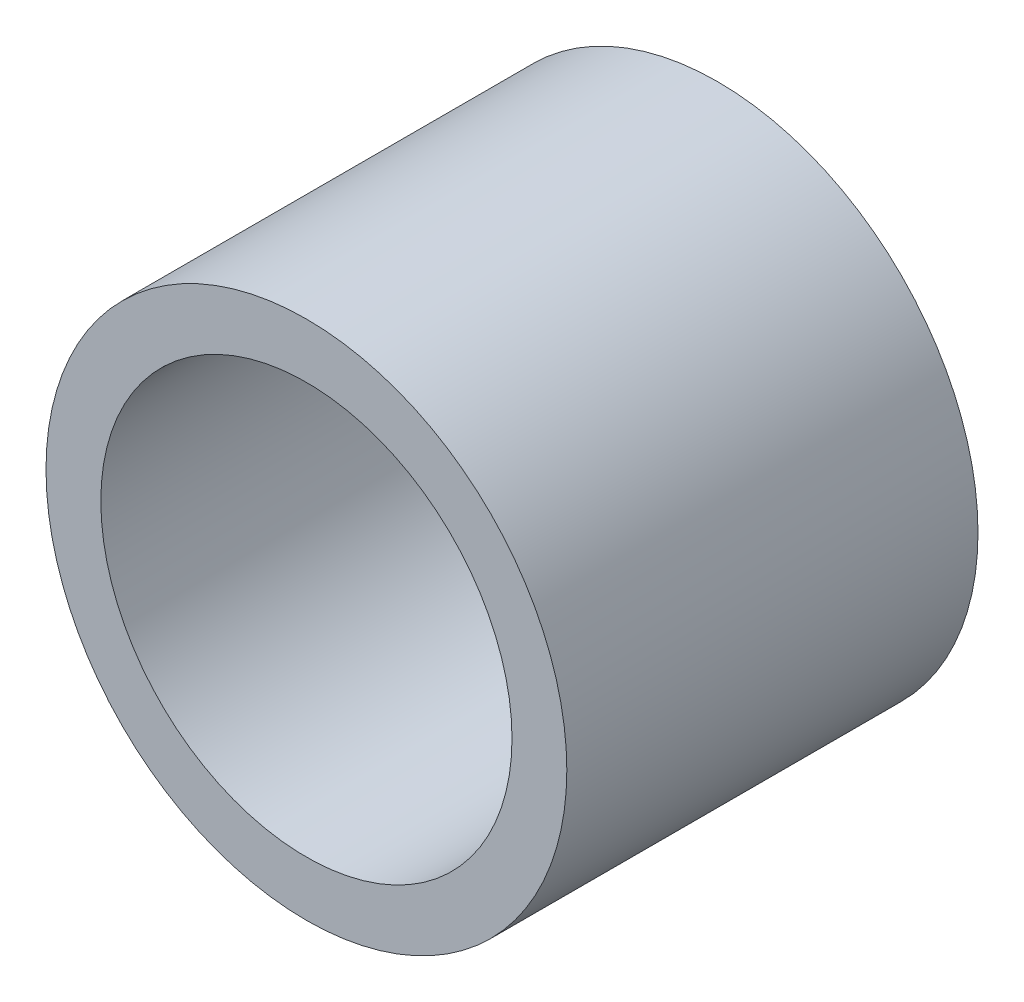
from build123d import *

# Parameters (mm, degrees)
ESQUISSE1_R      = 9.5
ESQUISSE1_R_2    = 7.5
EXTRUSION1_DEPTH = 15


with BuildPart() as part:
    # Esquisse1 → Extrusion1 (new body)
    with BuildSketch(Plane.XY):
        Circle(ESQUISSE1_R)
        Circle(ESQUISSE1_R_2, mode=Mode.SUBTRACT)
    extrude(amount=EXTRUSION1_DEPTH)


solid = part.part
